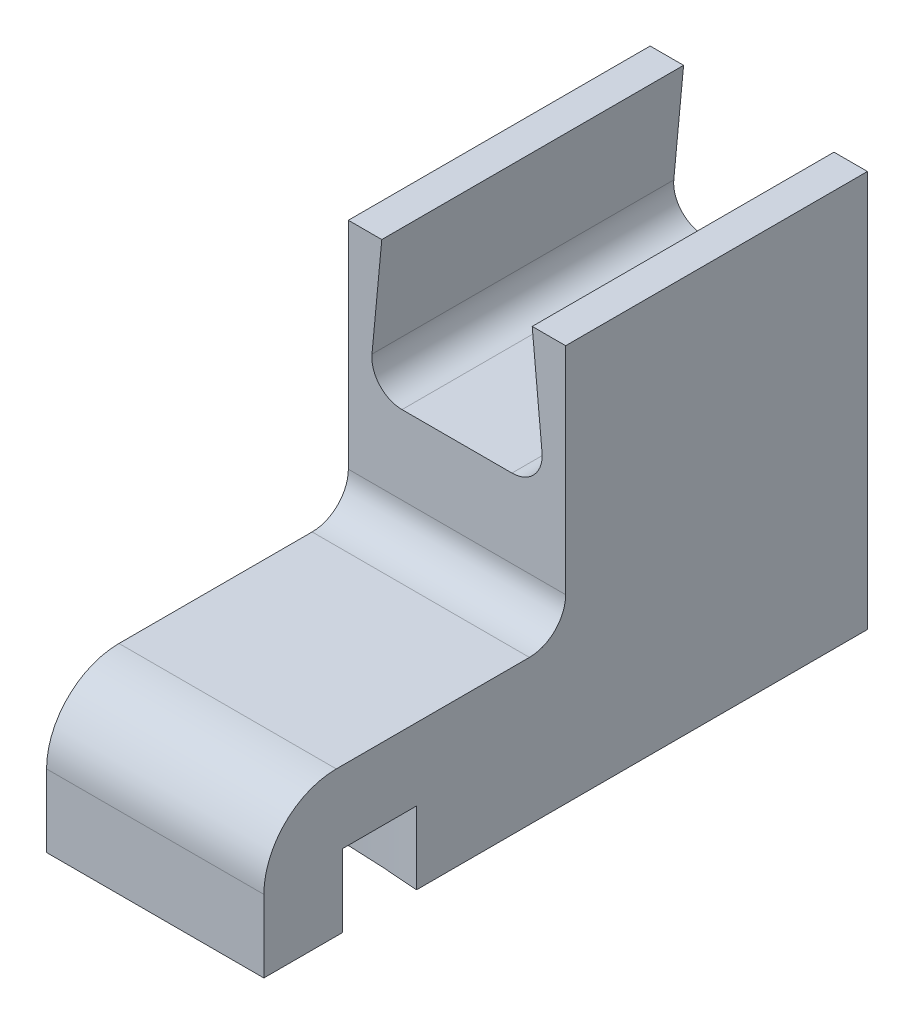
ISO-10303-21;
HEADER;
FILE_DESCRIPTION(('STEP AP214'),'2;1');
FILE_NAME('part.step','',(''),(''),'','','');
FILE_SCHEMA(('AUTOMOTIVE_DESIGN { 1 0 10303 214 1 1 1 1 }'));
ENDSEC;
DATA;
#1=APPLICATION_CONTEXT('core data for automotive mechanical design processes');
#2=APPLICATION_PROTOCOL_DEFINITION('international standard','automotive_design',2000,#1);
#3=PRODUCT_CONTEXT('',#1,'mechanical');
#4=PRODUCT('Part','Part','',(#3));
#5=PRODUCT_RELATED_PRODUCT_CATEGORY('part','',(#4));
#6=PRODUCT_DEFINITION_FORMATION('','',#4);
#7=PRODUCT_DEFINITION_CONTEXT('part definition',#1,'design');
#8=PRODUCT_DEFINITION('design','',#6,#7);
#9=PRODUCT_DEFINITION_SHAPE('','',#8);
#10=(LENGTH_UNIT() NAMED_UNIT(*) SI_UNIT(.MILLI.,.METRE.));
#11=(NAMED_UNIT(*) PLANE_ANGLE_UNIT() SI_UNIT($,.RADIAN.));
#12=(NAMED_UNIT(*) SI_UNIT($,.STERADIAN.) SOLID_ANGLE_UNIT());
#13=UNCERTAINTY_MEASURE_WITH_UNIT(LENGTH_MEASURE(1.E-05),#10,'distance_accuracy_value','');
#14=(GEOMETRIC_REPRESENTATION_CONTEXT(3) GLOBAL_UNCERTAINTY_ASSIGNED_CONTEXT((#13)) GLOBAL_UNIT_ASSIGNED_CONTEXT((#10,
#11,#12)) REPRESENTATION_CONTEXT('',''));
#15=CARTESIAN_POINT('',(0.,0.,0.));
#16=DIRECTION('',(0.,0.,1.));
#17=DIRECTION('',(1.,0.,0.));
#18=AXIS2_PLACEMENT_3D('',#15,#16,#17);
#19=CARTESIAN_POINT('',(-9.,-28.6,25.));
#20=DIRECTION('',(0.,1.,0.));
#21=DIRECTION('',(0.,0.,1.));
#22=AXIS2_PLACEMENT_3D('',#19,#20,#21);
#23=PLANE('',#22);
#24=DIRECTION('',(0.,0.,-1.));
#25=VECTOR('',#24,1.);
#26=CARTESIAN_POINT('',(-9.,-28.6,25.));
#27=LINE('',#26,#25);
#28=CARTESIAN_POINT('',(-9.,-28.6,50.));
#29=VERTEX_POINT('',#28);
#30=CARTESIAN_POINT('',(-9.,-28.6,43.482073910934));
#31=VERTEX_POINT('',#30);
#32=EDGE_CURVE('E261',#29,#31,#27,.T.);
#33=ORIENTED_EDGE('',*,*,#32,.T.);
#34=CARTESIAN_POINT('',(0.,-28.6,137.));
#35=DIRECTION('',(0.,1.,0.));
#36=DIRECTION('',(0.,0.,-1.));
#37=AXIS2_PLACEMENT_3D('',#34,#35,#36);
#38=CIRCLE('',#37,93.95);
#39=CARTESIAN_POINT('',(8.99999999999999,-28.6,43.482073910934));
#40=VERTEX_POINT('',#39);
#41=EDGE_CURVE('E164',#40,#31,#38,.T.);
#42=ORIENTED_EDGE('',*,*,#41,.F.);
#43=DIRECTION('',(0.,0.,-1.));
#44=VECTOR('',#43,1.);
#45=CARTESIAN_POINT('',(9.,-28.6,25.));
#46=LINE('',#45,#44);
#47=CARTESIAN_POINT('',(9.,-28.6,50.));
#48=VERTEX_POINT('',#47);
#49=EDGE_CURVE('E257',#48,#40,#46,.T.);
#50=ORIENTED_EDGE('',*,*,#49,.F.);
#51=DIRECTION('',(-1.,0.,0.));
#52=VECTOR('',#51,1.);
#53=CARTESIAN_POINT('',(-9.,-28.6,50.));
#54=LINE('',#53,#52);
#55=EDGE_CURVE('E193',#48,#29,#54,.T.);
#56=ORIENTED_EDGE('',*,*,#55,.T.);
#57=EDGE_LOOP('',(#33,#42,#50,#56));
#58=FACE_BOUND('',#57,.T.);
#59=ADVANCED_FACE('F35',(#58),#23,.F.);
#60=CARTESIAN_POINT('',(0.,0.,25.));
#61=DIRECTION('',(0.,0.,1.));
#62=DIRECTION('',(1.,0.,0.));
#63=AXIS2_PLACEMENT_3D('',#60,#61,#62);
#64=PLANE('',#63);
#65=DIRECTION('',(0.,-1.,0.));
#66=VECTOR('',#65,1.);
#67=CARTESIAN_POINT('',(-9.,4.26,25.));
#68=LINE('',#67,#66);
#69=CARTESIAN_POINT('',(-9.,4.26,25.));
#70=VERTEX_POINT('',#69);
#71=CARTESIAN_POINT('',(-9.,-13.6,25.));
#72=VERTEX_POINT('',#71);
#73=EDGE_CURVE('E212',#70,#72,#68,.T.);
#74=ORIENTED_EDGE('',*,*,#73,.T.);
#75=DIRECTION('',(1.,0.,0.));
#76=VECTOR('',#75,1.);
#77=CARTESIAN_POINT('',(0.,-13.6,25.));
#78=LINE('',#77,#76);
#79=CARTESIAN_POINT('',(9.,-13.6,25.));
#80=VERTEX_POINT('',#79);
#81=EDGE_CURVE('E294',#72,#80,#78,.T.);
#82=ORIENTED_EDGE('',*,*,#81,.T.);
#83=DIRECTION('',(0.,1.,0.));
#84=VECTOR('',#83,1.);
#85=CARTESIAN_POINT('',(9.,-28.6,25.));
#86=LINE('',#85,#84);
#87=CARTESIAN_POINT('',(9.,4.26,25.));
#88=VERTEX_POINT('',#87);
#89=EDGE_CURVE('E216',#80,#88,#86,.T.);
#90=ORIENTED_EDGE('',*,*,#89,.T.);
#91=DIRECTION('',(-1.,0.,0.));
#92=VECTOR('',#91,1.);
#93=CARTESIAN_POINT('',(9.,4.26,25.));
#94=LINE('',#93,#92);
#95=CARTESIAN_POINT('',(6.23,4.26,25.));
#96=VERTEX_POINT('',#95);
#97=EDGE_CURVE('E218',#88,#96,#94,.T.);
#98=ORIENTED_EDGE('',*,*,#97,.T.);
#99=DIRECTION('',(0.0937750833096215,-0.995593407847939,0.));
#100=VECTOR('',#99,1.);
#101=CARTESIAN_POINT('',(6.23,4.26,25.));
#102=LINE('',#101,#100);
#103=CARTESIAN_POINT('',(7.0424429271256,-4.36556229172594,25.));
#104=VERTEX_POINT('',#103);
#105=EDGE_CURVE('E220',#96,#104,#102,.T.);
#106=ORIENTED_EDGE('',*,*,#105,.T.);
#107=CARTESIAN_POINT('',(4.55345940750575,-4.6,25.));
#108=DIRECTION('',(0.,0.,1.));
#109=DIRECTION('',(1.,0.,0.));
#110=AXIS2_PLACEMENT_3D('',#107,#108,#109);
#111=CIRCLE('',#110,2.5);
#112=CARTESIAN_POINT('',(4.55345940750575,-7.1,25.));
#113=VERTEX_POINT('',#112);
#114=EDGE_CURVE('E282',#104,#113,#111,.F.);
#115=ORIENTED_EDGE('',*,*,#114,.T.);
#116=DIRECTION('',(-1.,0.,0.));
#117=VECTOR('',#116,1.);
#118=CARTESIAN_POINT('',(7.3,-7.1,25.));
#119=LINE('',#118,#117);
#120=CARTESIAN_POINT('',(-4.55345940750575,-7.1,25.));
#121=VERTEX_POINT('',#120);
#122=EDGE_CURVE('E223',#113,#121,#119,.T.);
#123=ORIENTED_EDGE('',*,*,#122,.T.);
#124=CARTESIAN_POINT('',(-4.55345940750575,-4.6,25.));
#125=DIRECTION('',(0.,0.,1.));
#126=DIRECTION('',(1.,0.,0.));
#127=AXIS2_PLACEMENT_3D('',#124,#125,#126);
#128=CIRCLE('',#127,2.5);
#129=CARTESIAN_POINT('',(-7.04244292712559,-4.36556229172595,25.));
#130=VERTEX_POINT('',#129);
#131=EDGE_CURVE('E278',#121,#130,#128,.F.);
#132=ORIENTED_EDGE('',*,*,#131,.T.);
#133=DIRECTION('',(0.093775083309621,0.995593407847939,0.));
#134=VECTOR('',#133,1.);
#135=CARTESIAN_POINT('',(-7.3,-7.1,25.));
#136=LINE('',#135,#134);
#137=CARTESIAN_POINT('',(-6.23,4.26,25.));
#138=VERTEX_POINT('',#137);
#139=EDGE_CURVE('E226',#130,#138,#136,.T.);
#140=ORIENTED_EDGE('',*,*,#139,.T.);
#141=DIRECTION('',(-1.,0.,0.));
#142=VECTOR('',#141,1.);
#143=CARTESIAN_POINT('',(-6.23,4.26,25.));
#144=LINE('',#143,#142);
#145=EDGE_CURVE('E209',#138,#70,#144,.T.);
#146=ORIENTED_EDGE('',*,*,#145,.T.);
#147=EDGE_LOOP('',(#74,#82,#90,#98,#106,#115,#123,#132,#140,#146));
#148=FACE_BOUND('',#147,.T.);
#149=ADVANCED_FACE('F299',(#148),#64,.T.);
#150=CARTESIAN_POINT('',(-6.23,4.26,25.));
#151=DIRECTION('',(0.,-1.,0.));
#152=DIRECTION('',(0.,0.,-1.));
#153=AXIS2_PLACEMENT_3D('',#150,#151,#152);
#154=PLANE('',#153);
#155=DIRECTION('',(-1.,0.,0.));
#156=VECTOR('',#155,1.);
#157=CARTESIAN_POINT('',(-6.23,4.26,0.));
#158=LINE('',#157,#156);
#159=CARTESIAN_POINT('',(-6.23,4.26,0.));
#160=VERTEX_POINT('',#159);
#161=CARTESIAN_POINT('',(-9.,4.26,0.));
#162=VERTEX_POINT('',#161);
#163=EDGE_CURVE('E207',#160,#162,#158,.T.);
#164=ORIENTED_EDGE('',*,*,#163,.T.);
#165=DIRECTION('',(0.,0.,-1.));
#166=VECTOR('',#165,1.);
#167=CARTESIAN_POINT('',(-9.,4.26,25.));
#168=LINE('',#167,#166);
#169=EDGE_CURVE('E263',#70,#162,#168,.T.);
#170=ORIENTED_EDGE('',*,*,#169,.F.);
#171=ORIENTED_EDGE('',*,*,#145,.F.);
#172=DIRECTION('',(0.,0.,-1.));
#173=VECTOR('',#172,1.);
#174=CARTESIAN_POINT('',(-6.23,4.26,25.));
#175=LINE('',#174,#173);
#176=EDGE_CURVE('E228',#138,#160,#175,.T.);
#177=ORIENTED_EDGE('',*,*,#176,.T.);
#178=EDGE_LOOP('',(#164,#170,#171,#177));
#179=FACE_BOUND('',#178,.T.);
#180=ADVANCED_FACE('F338',(#179),#154,.F.);
#181=CARTESIAN_POINT('',(-9.,4.26,25.));
#182=DIRECTION('',(1.,0.,0.));
#183=DIRECTION('',(0.,0.,-1.));
#184=AXIS2_PLACEMENT_3D('',#181,#182,#183);
#185=PLANE('',#184);
#186=DIRECTION('',(0.,-1.,0.));
#187=VECTOR('',#186,1.);
#188=CARTESIAN_POINT('',(-9.,-16.6,50.));
#189=LINE('',#188,#187);
#190=CARTESIAN_POINT('',(-9.,-22.6,50.));
#191=VERTEX_POINT('',#190);
#192=EDGE_CURVE('E205',#191,#29,#189,.T.);
#193=ORIENTED_EDGE('',*,*,#192,.F.);
#194=CARTESIAN_POINT('',(-9.,-22.6,44.));
#195=DIRECTION('',(1.,0.,0.));
#196=DIRECTION('',(0.,0.,-1.));
#197=AXIS2_PLACEMENT_3D('',#194,#195,#196);
#198=CIRCLE('',#197,6.);
#199=CARTESIAN_POINT('',(-9.,-16.6,44.));
#200=VERTEX_POINT('',#199);
#201=EDGE_CURVE('E287',#191,#200,#198,.F.);
#202=ORIENTED_EDGE('',*,*,#201,.T.);
#203=DIRECTION('',(0.,0.,-1.));
#204=VECTOR('',#203,1.);
#205=CARTESIAN_POINT('',(-9.,-16.6,50.));
#206=LINE('',#205,#204);
#207=CARTESIAN_POINT('',(-9.,-16.6,28.));
#208=VERTEX_POINT('',#207);
#209=EDGE_CURVE('E198',#200,#208,#206,.T.);
#210=ORIENTED_EDGE('',*,*,#209,.T.);
#211=CARTESIAN_POINT('',(-9.,-13.6,28.));
#212=DIRECTION('',(1.,0.,0.));
#213=DIRECTION('',(0.,0.,-1.));
#214=AXIS2_PLACEMENT_3D('',#211,#212,#213);
#215=CIRCLE('',#214,3.);
#216=EDGE_CURVE('E11',#208,#72,#215,.T.);
#217=ORIENTED_EDGE('',*,*,#216,.T.);
#218=ORIENTED_EDGE('',*,*,#73,.F.);
#219=ORIENTED_EDGE('',*,*,#169,.T.);
#220=DIRECTION('',(0.,-1.,0.));
#221=VECTOR('',#220,1.);
#222=CARTESIAN_POINT('',(-9.,4.26,0.));
#223=LINE('',#222,#221);
#224=CARTESIAN_POINT('',(-9.,-28.6,0.));
#225=VERTEX_POINT('',#224);
#226=EDGE_CURVE('E231',#162,#225,#223,.T.);
#227=ORIENTED_EDGE('',*,*,#226,.T.);
#228=CARTESIAN_POINT('',(-9.,-28.6,37.3556198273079));
#229=VERTEX_POINT('',#228);
#230=EDGE_CURVE('E260',#229,#225,#27,.T.);
#231=ORIENTED_EDGE('',*,*,#230,.F.);
#232=DIRECTION('',(0.,-1.,0.));
#233=VECTOR('',#232,1.);
#234=CARTESIAN_POINT('',(-9.,-22.58,37.3556198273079));
#235=LINE('',#234,#233);
#236=CARTESIAN_POINT('',(-9.,-22.58,37.3556198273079));
#237=VERTEX_POINT('',#236);
#238=EDGE_CURVE('E169',#237,#229,#235,.T.);
#239=ORIENTED_EDGE('',*,*,#238,.F.);
#240=DIRECTION('',(0.,0.,-1.));
#241=VECTOR('',#240,1.);
#242=CARTESIAN_POINT('',(-9.,-22.58,43.482073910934));
#243=LINE('',#242,#241);
#244=CARTESIAN_POINT('',(-9.,-22.58,43.482073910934));
#245=VERTEX_POINT('',#244);
#246=EDGE_CURVE('E175',#245,#237,#243,.T.);
#247=ORIENTED_EDGE('',*,*,#246,.F.);
#248=DIRECTION('',(0.,-1.,0.));
#249=VECTOR('',#248,1.);
#250=CARTESIAN_POINT('',(-9.,-22.58,43.482073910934));
#251=LINE('',#250,#249);
#252=EDGE_CURVE('E158',#245,#31,#251,.T.);
#253=ORIENTED_EDGE('',*,*,#252,.T.);
#254=ORIENTED_EDGE('',*,*,#32,.F.);
#255=EDGE_LOOP('',(#193,#202,#210,#217,#218,#219,#227,#231,#239,#247,#253,#254));
#256=FACE_BOUND('',#255,.T.);
#257=ADVANCED_FACE('F182',(#256),#185,.F.);
#258=CARTESIAN_POINT('',(8.99999999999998,-28.6,37.3556198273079));
#259=VERTEX_POINT('',#258);
#260=CARTESIAN_POINT('',(9.,-28.6,0.));
#261=VERTEX_POINT('',#260);
#262=EDGE_CURVE('E256',#259,#261,#46,.T.);
#263=ORIENTED_EDGE('',*,*,#262,.F.);
#264=CARTESIAN_POINT('',(0.,-28.6,137.));
#265=DIRECTION('',(0.,-1.,0.));
#266=DIRECTION('',(0.,0.,-1.));
#267=AXIS2_PLACEMENT_3D('',#264,#265,#266);
#268=CIRCLE('',#267,100.05);
#269=EDGE_CURVE('E179',#229,#259,#268,.T.);
#270=ORIENTED_EDGE('',*,*,#269,.F.);
#271=ORIENTED_EDGE('',*,*,#230,.T.);
#272=DIRECTION('',(1.,0.,0.));
#273=VECTOR('',#272,1.);
#274=CARTESIAN_POINT('',(-9.,-28.6,0.));
#275=LINE('',#274,#273);
#276=EDGE_CURVE('E234',#225,#261,#275,.T.);
#277=ORIENTED_EDGE('',*,*,#276,.T.);
#278=EDGE_LOOP('',(#263,#270,#271,#277));
#279=FACE_BOUND('',#278,.T.);
#280=ADVANCED_FACE('F349',(#279),#23,.F.);
#281=CARTESIAN_POINT('',(9.,-28.6,25.));
#282=DIRECTION('',(-1.,0.,0.));
#283=DIRECTION('',(0.,-1.,0.));
#284=AXIS2_PLACEMENT_3D('',#281,#282,#283);
#285=PLANE('',#284);
#286=ORIENTED_EDGE('',*,*,#89,.F.);
#287=CARTESIAN_POINT('',(9.,-13.6,28.));
#288=DIRECTION('',(-1.,0.,0.));
#289=DIRECTION('',(0.,-1.,0.));
#290=AXIS2_PLACEMENT_3D('',#287,#288,#289);
#291=CIRCLE('',#290,3.);
#292=CARTESIAN_POINT('',(9.,-16.6,28.));
#293=VERTEX_POINT('',#292);
#294=EDGE_CURVE('E43',#80,#293,#291,.T.);
#295=ORIENTED_EDGE('',*,*,#294,.T.);
#296=DIRECTION('',(0.,0.,1.));
#297=VECTOR('',#296,1.);
#298=CARTESIAN_POINT('',(9.,-16.6,50.));
#299=LINE('',#298,#297);
#300=CARTESIAN_POINT('',(9.,-16.6,44.));
#301=VERTEX_POINT('',#300);
#302=EDGE_CURVE('E200',#293,#301,#299,.T.);
#303=ORIENTED_EDGE('',*,*,#302,.T.);
#304=CARTESIAN_POINT('',(9.,-22.6,44.));
#305=DIRECTION('',(-1.,0.,0.));
#306=DIRECTION('',(0.,-1.,0.));
#307=AXIS2_PLACEMENT_3D('',#304,#305,#306);
#308=CIRCLE('',#307,6.);
#309=CARTESIAN_POINT('',(9.,-22.6,50.));
#310=VERTEX_POINT('',#309);
#311=EDGE_CURVE('E292',#301,#310,#308,.F.);
#312=ORIENTED_EDGE('',*,*,#311,.T.);
#313=DIRECTION('',(0.,-1.,0.));
#314=VECTOR('',#313,1.);
#315=CARTESIAN_POINT('',(9.,-16.6,50.));
#316=LINE('',#315,#314);
#317=EDGE_CURVE('E202',#310,#48,#316,.T.);
#318=ORIENTED_EDGE('',*,*,#317,.T.);
#319=ORIENTED_EDGE('',*,*,#49,.T.);
#320=DIRECTION('',(0.,-1.,0.));
#321=VECTOR('',#320,1.);
#322=CARTESIAN_POINT('',(8.99999999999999,-22.58,43.482073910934));
#323=LINE('',#322,#321);
#324=CARTESIAN_POINT('',(8.99999999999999,-22.58,43.482073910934));
#325=VERTEX_POINT('',#324);
#326=EDGE_CURVE('E191',#325,#40,#323,.T.);
#327=ORIENTED_EDGE('',*,*,#326,.F.);
#328=DIRECTION('',(0.,0.,1.));
#329=VECTOR('',#328,1.);
#330=CARTESIAN_POINT('',(8.99999999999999,-22.58,43.482073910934));
#331=LINE('',#330,#329);
#332=CARTESIAN_POINT('',(9.,-22.58,37.3556198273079));
#333=VERTEX_POINT('',#332);
#334=EDGE_CURVE('E170',#333,#325,#331,.T.);
#335=ORIENTED_EDGE('',*,*,#334,.F.);
#336=DIRECTION('',(0.,-1.,0.));
#337=VECTOR('',#336,1.);
#338=CARTESIAN_POINT('',(8.99999999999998,-22.58,37.3556198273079));
#339=LINE('',#338,#337);
#340=EDGE_CURVE('E194',#333,#259,#339,.T.);
#341=ORIENTED_EDGE('',*,*,#340,.T.);
#342=ORIENTED_EDGE('',*,*,#262,.T.);
#343=DIRECTION('',(0.,1.,0.));
#344=VECTOR('',#343,1.);
#345=CARTESIAN_POINT('',(9.,-28.6,0.));
#346=LINE('',#345,#344);
#347=CARTESIAN_POINT('',(9.,4.26,0.));
#348=VERTEX_POINT('',#347);
#349=EDGE_CURVE('E237',#261,#348,#346,.T.);
#350=ORIENTED_EDGE('',*,*,#349,.T.);
#351=DIRECTION('',(0.,0.,-1.));
#352=VECTOR('',#351,1.);
#353=CARTESIAN_POINT('',(9.,4.26,25.));
#354=LINE('',#353,#352);
#355=EDGE_CURVE('E253',#88,#348,#354,.T.);
#356=ORIENTED_EDGE('',*,*,#355,.F.);
#357=EDGE_LOOP('',(#286,#295,#303,#312,#318,#319,#327,#335,#341,#342,#350,#356));
#358=FACE_BOUND('',#357,.T.);
#359=ADVANCED_FACE('F303',(#358),#285,.F.);
#360=CARTESIAN_POINT('',(9.,4.26,25.));
#361=DIRECTION('',(0.,-1.,0.));
#362=DIRECTION('',(1.,0.,0.));
#363=AXIS2_PLACEMENT_3D('',#360,#361,#362);
#364=PLANE('',#363);
#365=DIRECTION('',(-1.,0.,0.));
#366=VECTOR('',#365,1.);
#367=CARTESIAN_POINT('',(9.,4.26,0.));
#368=LINE('',#367,#366);
#369=CARTESIAN_POINT('',(6.23,4.26,0.));
#370=VERTEX_POINT('',#369);
#371=EDGE_CURVE('E239',#348,#370,#368,.T.);
#372=ORIENTED_EDGE('',*,*,#371,.T.);
#373=DIRECTION('',(0.,0.,-1.));
#374=VECTOR('',#373,1.);
#375=CARTESIAN_POINT('',(6.23,4.26,25.));
#376=LINE('',#375,#374);
#377=EDGE_CURVE('E250',#96,#370,#376,.T.);
#378=ORIENTED_EDGE('',*,*,#377,.F.);
#379=ORIENTED_EDGE('',*,*,#97,.F.);
#380=ORIENTED_EDGE('',*,*,#355,.T.);
#381=EDGE_LOOP('',(#372,#378,#379,#380));
#382=FACE_BOUND('',#381,.T.);
#383=ADVANCED_FACE('F309',(#382),#364,.F.);
#384=CARTESIAN_POINT('',(6.23,4.26,25.));
#385=DIRECTION('',(0.995593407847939,0.0937750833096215,0.));
#386=DIRECTION('',(-0.0937750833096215,0.99559340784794,0.));
#387=AXIS2_PLACEMENT_3D('',#384,#385,#386);
#388=PLANE('',#387);
#389=DIRECTION('',(0.0937750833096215,-0.995593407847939,0.));
#390=VECTOR('',#389,1.);
#391=CARTESIAN_POINT('',(6.23,4.26,0.));
#392=LINE('',#391,#390);
#393=CARTESIAN_POINT('',(7.0424429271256,-4.36556229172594,0.));
#394=VERTEX_POINT('',#393);
#395=EDGE_CURVE('E241',#370,#394,#392,.T.);
#396=ORIENTED_EDGE('',*,*,#395,.T.);
#397=DIRECTION('',(0.,0.,-1.));
#398=VECTOR('',#397,1.);
#399=CARTESIAN_POINT('',(7.0424429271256,-4.36556229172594,25.));
#400=LINE('',#399,#398);
#401=EDGE_CURVE('E274',#394,#104,#400,.F.);
#402=ORIENTED_EDGE('',*,*,#401,.T.);
#403=ORIENTED_EDGE('',*,*,#105,.F.);
#404=ORIENTED_EDGE('',*,*,#377,.T.);
#405=EDGE_LOOP('',(#396,#402,#403,#404));
#406=FACE_BOUND('',#405,.T.);
#407=ADVANCED_FACE('F389',(#406),#388,.F.);
#408=CARTESIAN_POINT('',(7.3,-7.1,25.));
#409=DIRECTION('',(0.,-1.,0.));
#410=DIRECTION('',(1.,0.,0.));
#411=AXIS2_PLACEMENT_3D('',#408,#409,#410);
#412=PLANE('',#411);
#413=DIRECTION('',(-1.,0.,0.));
#414=VECTOR('',#413,1.);
#415=CARTESIAN_POINT('',(7.3,-7.1,0.));
#416=LINE('',#415,#414);
#417=CARTESIAN_POINT('',(4.55345940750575,-7.1,0.));
#418=VERTEX_POINT('',#417);
#419=CARTESIAN_POINT('',(-4.55345940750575,-7.1,0.));
#420=VERTEX_POINT('',#419);
#421=EDGE_CURVE('E244',#418,#420,#416,.T.);
#422=ORIENTED_EDGE('',*,*,#421,.T.);
#423=DIRECTION('',(0.,0.,-1.));
#424=VECTOR('',#423,1.);
#425=CARTESIAN_POINT('',(-4.55345940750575,-7.1,25.));
#426=LINE('',#425,#424);
#427=EDGE_CURVE('E272',#420,#121,#426,.F.);
#428=ORIENTED_EDGE('',*,*,#427,.T.);
#429=ORIENTED_EDGE('',*,*,#122,.F.);
#430=DIRECTION('',(0.,0.,-1.));
#431=VECTOR('',#430,1.);
#432=CARTESIAN_POINT('',(4.55345940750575,-7.1,0.));
#433=LINE('',#432,#431);
#434=EDGE_CURVE('E269',#113,#418,#433,.T.);
#435=ORIENTED_EDGE('',*,*,#434,.T.);
#436=EDGE_LOOP('',(#422,#428,#429,#435));
#437=FACE_BOUND('',#436,.T.);
#438=ADVANCED_FACE('F320',(#437),#412,.F.);
#439=CARTESIAN_POINT('',(-7.3,-7.1,25.));
#440=DIRECTION('',(-0.995593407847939,0.093775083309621,0.));
#441=DIRECTION('',(-0.093775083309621,-0.995593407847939,0.));
#442=AXIS2_PLACEMENT_3D('',#439,#440,#441);
#443=PLANE('',#442);
#444=ORIENTED_EDGE('',*,*,#139,.F.);
#445=DIRECTION('',(0.,0.,-1.));
#446=VECTOR('',#445,1.);
#447=CARTESIAN_POINT('',(-7.04244292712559,-4.36556229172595,0.));
#448=LINE('',#447,#446);
#449=CARTESIAN_POINT('',(-7.04244292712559,-4.36556229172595,0.));
#450=VERTEX_POINT('',#449);
#451=EDGE_CURVE('E266',#130,#450,#448,.T.);
#452=ORIENTED_EDGE('',*,*,#451,.T.);
#453=DIRECTION('',(0.093775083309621,0.995593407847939,0.));
#454=VECTOR('',#453,1.);
#455=CARTESIAN_POINT('',(-7.3,-7.1,0.));
#456=LINE('',#455,#454);
#457=EDGE_CURVE('E213',#450,#160,#456,.T.);
#458=ORIENTED_EDGE('',*,*,#457,.T.);
#459=ORIENTED_EDGE('',*,*,#176,.F.);
#460=EDGE_LOOP('',(#444,#452,#458,#459));
#461=FACE_BOUND('',#460,.T.);
#462=ADVANCED_FACE('F333',(#461),#443,.F.);
#463=CARTESIAN_POINT('',(0.,0.,0.));
#464=DIRECTION('',(0.,0.,1.));
#465=DIRECTION('',(1.,0.,0.));
#466=AXIS2_PLACEMENT_3D('',#463,#464,#465);
#467=PLANE('',#466);
#468=ORIENTED_EDGE('',*,*,#163,.F.);
#469=ORIENTED_EDGE('',*,*,#457,.F.);
#470=CARTESIAN_POINT('',(-4.55345940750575,-4.6,0.));
#471=DIRECTION('',(0.,0.,1.));
#472=DIRECTION('',(1.,0.,0.));
#473=AXIS2_PLACEMENT_3D('',#470,#471,#472);
#474=CIRCLE('',#473,2.5);
#475=EDGE_CURVE('E276',#450,#420,#474,.T.);
#476=ORIENTED_EDGE('',*,*,#475,.T.);
#477=ORIENTED_EDGE('',*,*,#421,.F.);
#478=CARTESIAN_POINT('',(4.55345940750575,-4.6,0.));
#479=DIRECTION('',(0.,0.,1.));
#480=DIRECTION('',(1.,0.,0.));
#481=AXIS2_PLACEMENT_3D('',#478,#479,#480);
#482=CIRCLE('',#481,2.5);
#483=EDGE_CURVE('E280',#418,#394,#482,.T.);
#484=ORIENTED_EDGE('',*,*,#483,.T.);
#485=ORIENTED_EDGE('',*,*,#395,.F.);
#486=ORIENTED_EDGE('',*,*,#371,.F.);
#487=ORIENTED_EDGE('',*,*,#349,.F.);
#488=ORIENTED_EDGE('',*,*,#276,.F.);
#489=ORIENTED_EDGE('',*,*,#226,.F.);
#490=EDGE_LOOP('',(#468,#469,#476,#477,#484,#485,#486,#487,#488,#489));
#491=FACE_BOUND('',#490,.T.);
#492=ADVANCED_FACE('F324',(#491),#467,.F.);
#493=CARTESIAN_POINT('',(-9.,-16.6,50.));
#494=DIRECTION('',(0.,0.,1.));
#495=DIRECTION('',(1.,0.,0.));
#496=AXIS2_PLACEMENT_3D('',#493,#494,#495);
#497=PLANE('',#496);
#498=ORIENTED_EDGE('',*,*,#317,.F.);
#499=DIRECTION('',(-1.,0.,0.));
#500=VECTOR('',#499,1.);
#501=CARTESIAN_POINT('',(-9.,-22.6,50.));
#502=LINE('',#501,#500);
#503=EDGE_CURVE('E284',#310,#191,#502,.T.);
#504=ORIENTED_EDGE('',*,*,#503,.T.);
#505=ORIENTED_EDGE('',*,*,#192,.T.);
#506=ORIENTED_EDGE('',*,*,#55,.F.);
#507=EDGE_LOOP('',(#498,#504,#505,#506));
#508=FACE_BOUND('',#507,.T.);
#509=ADVANCED_FACE('F379',(#508),#497,.T.);
#510=CARTESIAN_POINT('',(0.,-16.6,0.));
#511=DIRECTION('',(0.,-1.,0.));
#512=DIRECTION('',(0.,0.,-1.));
#513=AXIS2_PLACEMENT_3D('',#510,#511,#512);
#514=PLANE('',#513);
#515=ORIENTED_EDGE('',*,*,#302,.F.);
#516=DIRECTION('',(1.,0.,0.));
#517=VECTOR('',#516,1.);
#518=CARTESIAN_POINT('',(0.,-16.6,28.));
#519=LINE('',#518,#517);
#520=EDGE_CURVE('E56',#293,#208,#519,.F.);
#521=ORIENTED_EDGE('',*,*,#520,.T.);
#522=ORIENTED_EDGE('',*,*,#209,.F.);
#523=DIRECTION('',(-1.,0.,0.));
#524=VECTOR('',#523,1.);
#525=CARTESIAN_POINT('',(9.,-16.6,44.));
#526=LINE('',#525,#524);
#527=EDGE_CURVE('E289',#200,#301,#526,.F.);
#528=ORIENTED_EDGE('',*,*,#527,.T.);
#529=EDGE_LOOP('',(#515,#521,#522,#528));
#530=FACE_BOUND('',#529,.T.);
#531=ADVANCED_FACE('F374',(#530),#514,.F.);
#532=CARTESIAN_POINT('',(0.,-22.58,137.));
#533=DIRECTION('',(0.,-1.,0.));
#534=DIRECTION('',(0.,0.,-1.));
#535=AXIS2_PLACEMENT_3D('',#532,#533,#534);
#536=CYLINDRICAL_SURFACE('',#535,93.95);
#537=ORIENTED_EDGE('',*,*,#41,.T.);
#538=ORIENTED_EDGE('',*,*,#252,.F.);
#539=CARTESIAN_POINT('',(0.,-22.58,137.));
#540=DIRECTION('',(0.,1.,0.));
#541=DIRECTION('',(0.,0.,-1.));
#542=AXIS2_PLACEMENT_3D('',#539,#540,#541);
#543=CIRCLE('',#542,93.95);
#544=EDGE_CURVE('E161',#325,#245,#543,.T.);
#545=ORIENTED_EDGE('',*,*,#544,.F.);
#546=ORIENTED_EDGE('',*,*,#326,.T.);
#547=EDGE_LOOP('',(#537,#538,#545,#546));
#548=FACE_BOUND('',#547,.T.);
#549=ADVANCED_FACE('F160',(#548),#536,.T.);
#550=CARTESIAN_POINT('',(0.,-22.58,137.));
#551=DIRECTION('',(0.,-1.,0.));
#552=DIRECTION('',(0.,0.,-1.));
#553=AXIS2_PLACEMENT_3D('',#550,#551,#552);
#554=CYLINDRICAL_SURFACE('',#553,100.05);
#555=ORIENTED_EDGE('',*,*,#269,.T.);
#556=ORIENTED_EDGE('',*,*,#340,.F.);
#557=CARTESIAN_POINT('',(0.,-22.58,137.));
#558=DIRECTION('',(0.,-1.,0.));
#559=DIRECTION('',(0.,0.,-1.));
#560=AXIS2_PLACEMENT_3D('',#557,#558,#559);
#561=CIRCLE('',#560,100.05);
#562=EDGE_CURVE('E184',#237,#333,#561,.T.);
#563=ORIENTED_EDGE('',*,*,#562,.F.);
#564=ORIENTED_EDGE('',*,*,#238,.T.);
#565=EDGE_LOOP('',(#555,#556,#563,#564));
#566=FACE_BOUND('',#565,.T.);
#567=ADVANCED_FACE('F366',(#566),#554,.F.);
#568=CARTESIAN_POINT('',(0.,-22.58,137.));
#569=DIRECTION('',(0.,-1.,0.));
#570=DIRECTION('',(0.,0.,-1.));
#571=AXIS2_PLACEMENT_3D('',#568,#569,#570);
#572=PLANE('',#571);
#573=ORIENTED_EDGE('',*,*,#544,.T.);
#574=ORIENTED_EDGE('',*,*,#246,.T.);
#575=ORIENTED_EDGE('',*,*,#562,.T.);
#576=ORIENTED_EDGE('',*,*,#334,.T.);
#577=EDGE_LOOP('',(#573,#574,#575,#576));
#578=FACE_BOUND('',#577,.T.);
#579=ADVANCED_FACE('F174',(#578),#572,.T.);
#580=CARTESIAN_POINT('',(-4.55345940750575,-4.6,25.));
#581=DIRECTION('',(0.,0.,1.));
#582=DIRECTION('',(1.,0.,0.));
#583=AXIS2_PLACEMENT_3D('',#580,#581,#582);
#584=CYLINDRICAL_SURFACE('',#583,2.5);
#585=ORIENTED_EDGE('',*,*,#131,.F.);
#586=ORIENTED_EDGE('',*,*,#427,.F.);
#587=ORIENTED_EDGE('',*,*,#475,.F.);
#588=ORIENTED_EDGE('',*,*,#451,.F.);
#589=EDGE_LOOP('',(#585,#586,#587,#588));
#590=FACE_BOUND('',#589,.T.);
#591=ADVANCED_FACE('F330',(#590),#584,.F.);
#592=CARTESIAN_POINT('',(4.55345940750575,-4.6,25.));
#593=DIRECTION('',(0.,0.,1.));
#594=DIRECTION('',(1.,0.,0.));
#595=AXIS2_PLACEMENT_3D('',#592,#593,#594);
#596=CYLINDRICAL_SURFACE('',#595,2.5);
#597=ORIENTED_EDGE('',*,*,#114,.F.);
#598=ORIENTED_EDGE('',*,*,#401,.F.);
#599=ORIENTED_EDGE('',*,*,#483,.F.);
#600=ORIENTED_EDGE('',*,*,#434,.F.);
#601=EDGE_LOOP('',(#597,#598,#599,#600));
#602=FACE_BOUND('',#601,.T.);
#603=ADVANCED_FACE('F317',(#602),#596,.F.);
#604=CARTESIAN_POINT('',(-9.,-22.6,44.));
#605=DIRECTION('',(1.,0.,0.));
#606=DIRECTION('',(0.,0.,-1.));
#607=AXIS2_PLACEMENT_3D('',#604,#605,#606);
#608=CYLINDRICAL_SURFACE('',#607,6.);
#609=ORIENTED_EDGE('',*,*,#311,.F.);
#610=ORIENTED_EDGE('',*,*,#527,.F.);
#611=ORIENTED_EDGE('',*,*,#201,.F.);
#612=ORIENTED_EDGE('',*,*,#503,.F.);
#613=EDGE_LOOP('',(#609,#610,#611,#612));
#614=FACE_BOUND('',#613,.T.);
#615=ADVANCED_FACE('F341',(#614),#608,.T.);
#616=CARTESIAN_POINT('',(0.,-13.6,28.));
#617=DIRECTION('',(1.,0.,0.));
#618=DIRECTION('',(0.,0.,-1.));
#619=AXIS2_PLACEMENT_3D('',#616,#617,#618);
#620=CYLINDRICAL_SURFACE('',#619,3.);
#621=ORIENTED_EDGE('',*,*,#216,.F.);
#622=ORIENTED_EDGE('',*,*,#520,.F.);
#623=ORIENTED_EDGE('',*,*,#294,.F.);
#624=ORIENTED_EDGE('',*,*,#81,.F.);
#625=EDGE_LOOP('',(#621,#622,#623,#624));
#626=FACE_BOUND('',#625,.T.);
#627=ADVANCED_FACE('F37',(#626),#620,.F.);
#628=CLOSED_SHELL('',(#59,#149,#180,#257,#280,#359,#383,#407,#438,#462,#492,#509,#531,#549,#567,
#579,#591,#603,#615,#627));
#629=MANIFOLD_SOLID_BREP('B2',#628);
#630=ADVANCED_BREP_SHAPE_REPRESENTATION('',(#18,#629),#14);
#631=SHAPE_DEFINITION_REPRESENTATION(#9,#630);
ENDSEC;
END-ISO-10303-21;
